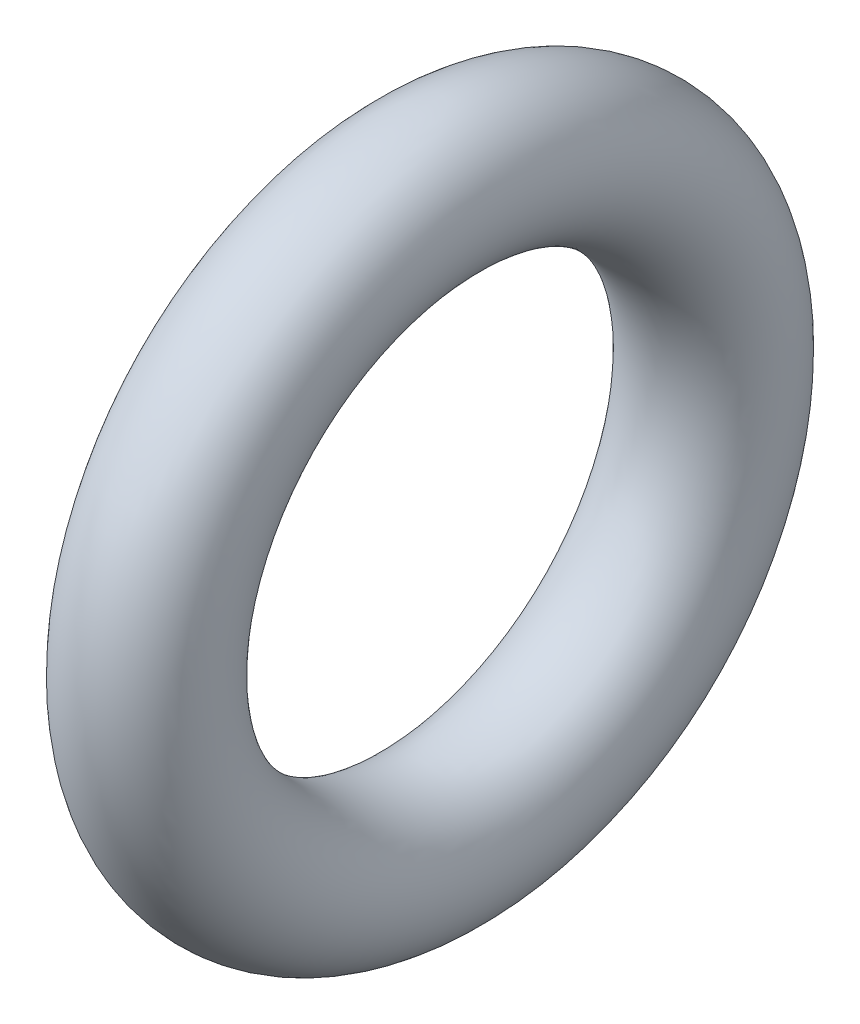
ISO-10303-21;
HEADER;
FILE_DESCRIPTION(('STEP AP214'),'2;1');
FILE_NAME('part.step','',(''),(''),'','','');
FILE_SCHEMA(('AUTOMOTIVE_DESIGN { 1 0 10303 214 1 1 1 1 }'));
ENDSEC;
DATA;
#1=APPLICATION_CONTEXT('core data for automotive mechanical design processes');
#2=APPLICATION_PROTOCOL_DEFINITION('international standard','automotive_design',2000,#1);
#3=PRODUCT_CONTEXT('',#1,'mechanical');
#4=PRODUCT('Part','Part','',(#3));
#5=PRODUCT_RELATED_PRODUCT_CATEGORY('part','',(#4));
#6=PRODUCT_DEFINITION_FORMATION('','',#4);
#7=PRODUCT_DEFINITION_CONTEXT('part definition',#1,'design');
#8=PRODUCT_DEFINITION('design','',#6,#7);
#9=PRODUCT_DEFINITION_SHAPE('','',#8);
#10=(LENGTH_UNIT() NAMED_UNIT(*) SI_UNIT(.MILLI.,.METRE.));
#11=(NAMED_UNIT(*) PLANE_ANGLE_UNIT() SI_UNIT($,.RADIAN.));
#12=(NAMED_UNIT(*) SI_UNIT($,.STERADIAN.) SOLID_ANGLE_UNIT());
#13=UNCERTAINTY_MEASURE_WITH_UNIT(LENGTH_MEASURE(1.E-05),#10,'distance_accuracy_value','');
#14=(GEOMETRIC_REPRESENTATION_CONTEXT(3) GLOBAL_UNCERTAINTY_ASSIGNED_CONTEXT((#13)) GLOBAL_UNIT_ASSIGNED_CONTEXT((#10,
#11,#12)) REPRESENTATION_CONTEXT('',''));
#15=CARTESIAN_POINT('',(0.,0.,0.));
#16=DIRECTION('',(0.,0.,1.));
#17=DIRECTION('',(1.,0.,0.));
#18=AXIS2_PLACEMENT_3D('',#15,#16,#17);
#19=CARTESIAN_POINT('',(0.,0.,0.));
#20=DIRECTION('',(-1.,0.,0.));
#21=DIRECTION('',(0.,0.,1.));
#22=AXIS2_PLACEMENT_3D('',#19,#20,#21);
#23=TOROIDAL_SURFACE('',#22,3.175,0.79375);
#24=CARTESIAN_POINT('',(0.,0.,3.96875));
#25=VERTEX_POINT('',#24);
#26=VERTEX_LOOP('',#25);
#27=FACE_BOUND('',#26,.T.);
#28=ADVANCED_FACE('F33',(#27),#23,.T.);
#29=CLOSED_SHELL('',(#28));
#30=MANIFOLD_SOLID_BREP('B2',#29);
#31=ADVANCED_BREP_SHAPE_REPRESENTATION('',(#18,#30),#14);
#32=SHAPE_DEFINITION_REPRESENTATION(#9,#31);
ENDSEC;
END-ISO-10303-21;
